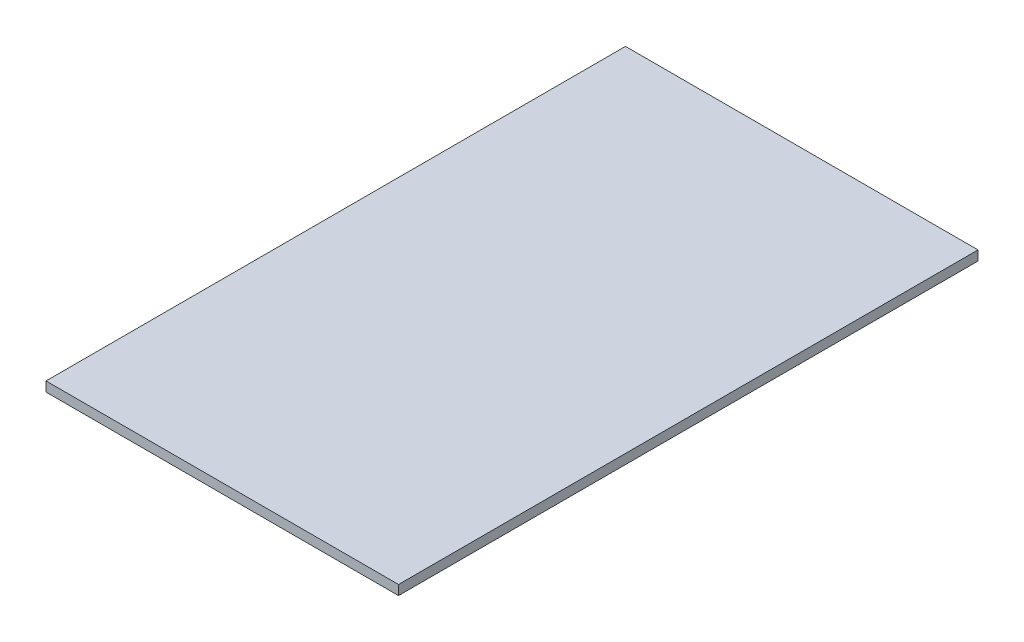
from build123d import *

# Parameters (mm, degrees)
SKETCH1_W           = 927.1
SKETCH1_H           = 1524
BOSS_EXTRUDE1_DEPTH = 25.4


with BuildPart() as part:
    # Sketch1 → Boss-Extrude1 (new body)
    with BuildSketch(Plane(origin=(0, 0, 0), x_dir=(1, 0, 0), z_dir=(0, 1, 0))):
        with Locations((463.55, 762)):
            Rectangle(SKETCH1_W, SKETCH1_H)
    extrude(amount=BOSS_EXTRUDE1_DEPTH)


solid = part.part
